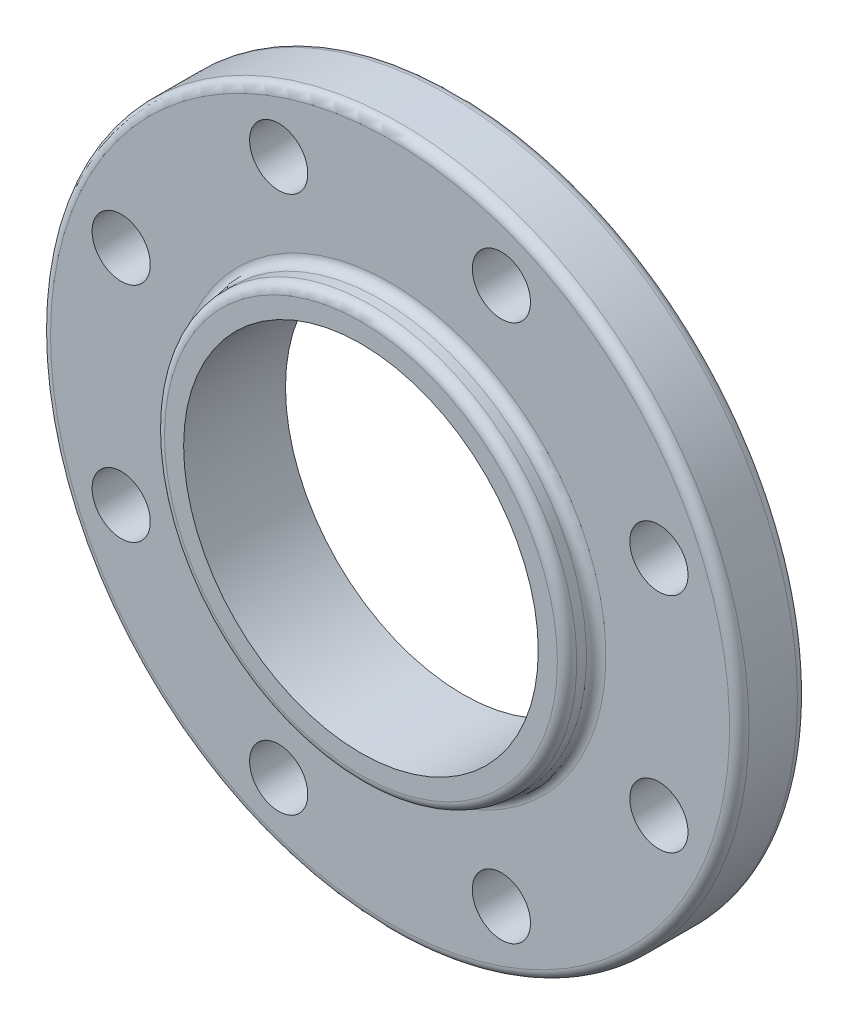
from build123d import *

# Parameters (mm, degrees)
SKETCH2_R          = 9.525
CUT_EXTRUDE1_DEPTH = 22.225
CIRPATTERN1_COUNT  = 8


with BuildPart() as part:
    # Sketch1 → Base-Revolve (revolve)
    with BuildSketch(Plane(origin=(0, 0, 0), x_dir=(1, 0, 0), z_dir=(0, 1, 0)), mode=Mode.PRIVATE) as base_revolve_sk:
        with BuildLine():
            Line((58.039, -33.3375), (58.039, 0))
            Line((58.039, 0), (78.58125, 0))
            Line((78.58125, 0), (78.58125, -0.0635))
            ThreePointArc((78.58125, -0.0635), (79.027619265, -1.141130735), (80.10525, -1.5875))
            Line((80.10525, -1.5875), (111.125, -1.5875))
            ThreePointArc((111.125, -1.5875), (113.37006403, -2.51743597), (114.3, -4.7625))
            Line((114.3, -4.7625), (114.3, -20.6375))
            ThreePointArc((114.3, -20.6375), (113.37006403, -22.88256403), (111.125, -23.8125))
            Line((111.125, -23.8125), (70.64375, -23.8125))
            ThreePointArc((70.64375, -23.8125), (68.39868597, -24.74243597), (67.46875, -26.9875))
            Line((67.46875, -26.9875), (67.46875, -30.1625))
            ThreePointArc((67.46875, -30.1625), (66.53881403, -32.40756403), (64.29375, -33.3375))
            Line((64.29375, -33.3375), (58.039, -33.3375))
        make_face()
    revolve(base_revolve_sk.sketch.rotate(Axis((0, 0, -94.093731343), (0, 0, 1)), 180), axis=Axis((0, 0, -94.093731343), (0, 0, 1)))

    # Sketch2 → Cut-Extrude1 (cut)
    with BuildSketch(Plane(origin=(0, 0, 1.5875), x_dir=(-1, 0, 0), z_dir=(0, 0, -1))):
        with Locations((36.450596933, 87.999525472)):
            Circle(SKETCH2_R)
    cut_extrude1 = extrude(amount=-CUT_EXTRUDE1_DEPTH, mode=Mode.SUBTRACT)

    # CirPattern1: Cut-Extrude1 ×8 about axis
    cirpattern1_axis = Axis((0, 0, 0), (0, 0, 1))
    for i in range(1, CIRPATTERN1_COUNT):
        add(cut_extrude1.rotate(cirpattern1_axis, i * 360 / CIRPATTERN1_COUNT), mode=Mode.SUBTRACT)


solid = part.part
